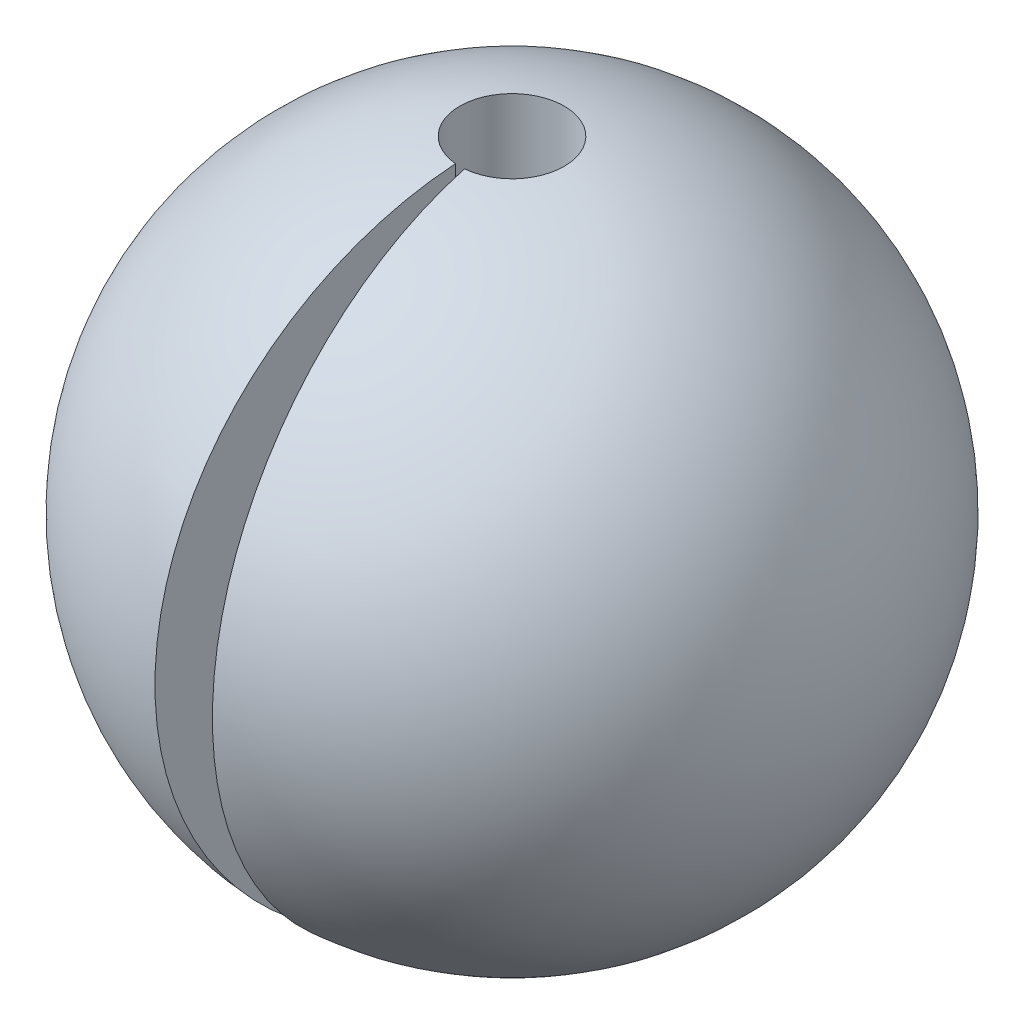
from build123d import *

# Parameters (mm, degrees)
CUT_EXTRUDE_1_DEPTH      = 3278.102226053
CUT_EXTRUDE_1_DEPTH_BACK = 3278.102226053


with BuildPart() as part:
    # Sketch 1 → Revolve 2 (revolve)
    with BuildSketch(Plane.XY):
        with BuildLine():
            Line((-301, 1876.006130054), (-301, -1876.006130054))
            ThreePointArc((-301, -1876.006130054), (-1900, 0), (-301, 1876.006130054))
        make_face()
    revolve(axis=Axis((0, 0, 0), (0, 1, 0)))

    # Sketch 2 → Cut-Extrude 1 (cut, two sides: drawn at the far end of the back side and taken through both)
    with BuildSketch(Plane(origin=(0, 0, 0), x_dir=(1, 0, 0), z_dir=(0, 1, 0)).offset(-CUT_EXTRUDE_1_DEPTH_BACK)):
        Polygon((0, 0), (-204.578400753, -2338.341820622), (204.578400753, -2338.341820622), align=None)
    extrude(amount=CUT_EXTRUDE_1_DEPTH + CUT_EXTRUDE_1_DEPTH_BACK, mode=Mode.SUBTRACT)


solid = part.part
